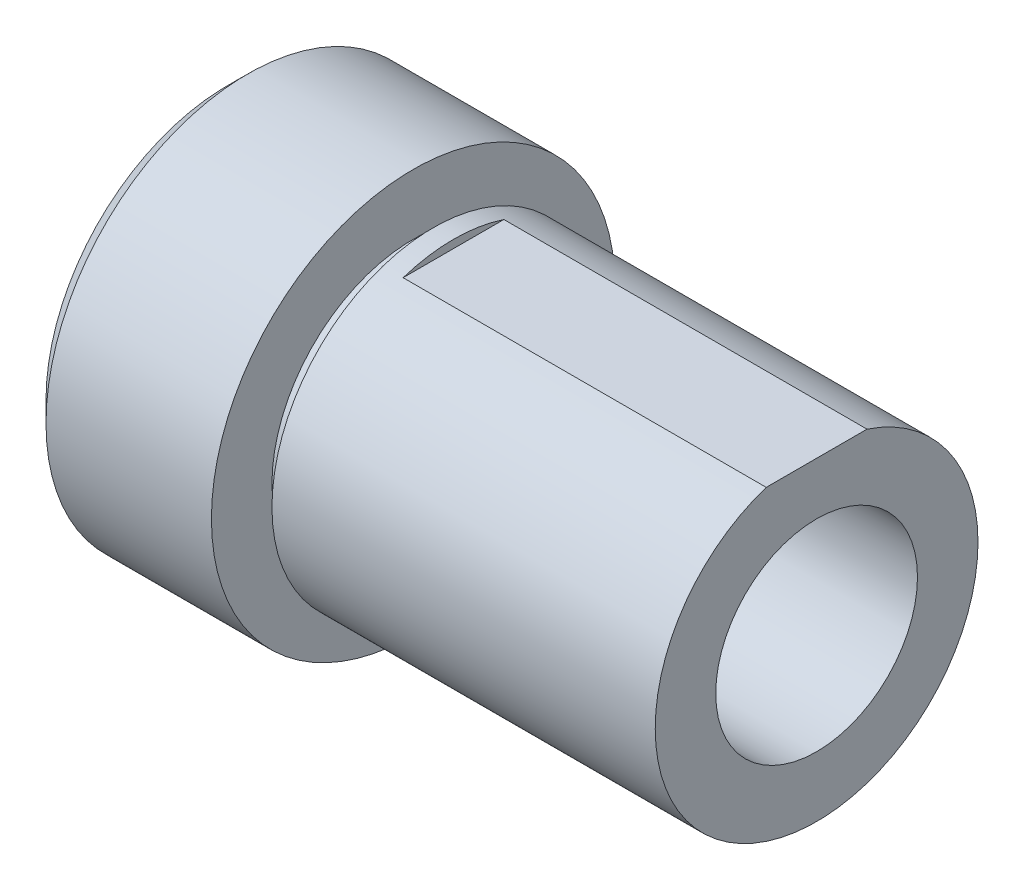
ISO-10303-21;
HEADER;
FILE_DESCRIPTION(('STEP AP214'),'2;1');
FILE_NAME('part.step','',(''),(''),'','','');
FILE_SCHEMA(('AUTOMOTIVE_DESIGN { 1 0 10303 214 1 1 1 1 }'));
ENDSEC;
DATA;
#1=APPLICATION_CONTEXT('core data for automotive mechanical design processes');
#2=APPLICATION_PROTOCOL_DEFINITION('international standard','automotive_design',2000,#1);
#3=PRODUCT_CONTEXT('',#1,'mechanical');
#4=PRODUCT('Part','Part','',(#3));
#5=PRODUCT_RELATED_PRODUCT_CATEGORY('part','',(#4));
#6=PRODUCT_DEFINITION_FORMATION('','',#4);
#7=PRODUCT_DEFINITION_CONTEXT('part definition',#1,'design');
#8=PRODUCT_DEFINITION('design','',#6,#7);
#9=PRODUCT_DEFINITION_SHAPE('','',#8);
#10=(LENGTH_UNIT() NAMED_UNIT(*) SI_UNIT(.MILLI.,.METRE.));
#11=(NAMED_UNIT(*) PLANE_ANGLE_UNIT() SI_UNIT($,.RADIAN.));
#12=(NAMED_UNIT(*) SI_UNIT($,.STERADIAN.) SOLID_ANGLE_UNIT());
#13=UNCERTAINTY_MEASURE_WITH_UNIT(LENGTH_MEASURE(1.E-05),#10,'distance_accuracy_value','');
#14=(GEOMETRIC_REPRESENTATION_CONTEXT(3) GLOBAL_UNCERTAINTY_ASSIGNED_CONTEXT((#13)) GLOBAL_UNIT_ASSIGNED_CONTEXT((#10,
#11,#12)) REPRESENTATION_CONTEXT('',''));
#15=CARTESIAN_POINT('',(0.,0.,0.));
#16=DIRECTION('',(0.,0.,1.));
#17=DIRECTION('',(1.,0.,0.));
#18=AXIS2_PLACEMENT_3D('',#15,#16,#17);
#19=CARTESIAN_POINT('',(4.6,0.,0.));
#20=DIRECTION('',(1.,0.,0.));
#21=DIRECTION('',(0.,0.,-1.));
#22=AXIS2_PLACEMENT_3D('',#19,#20,#21);
#23=PLANE('',#22);
#24=CARTESIAN_POINT('',(4.6,0.,0.));
#25=DIRECTION('',(1.,0.,0.));
#26=DIRECTION('',(0.,0.,-1.));
#27=AXIS2_PLACEMENT_3D('',#24,#25,#26);
#28=CIRCLE('',#27,5.);
#29=CARTESIAN_POINT('',(4.6,0.,-5.));
#30=VERTEX_POINT('',#29);
#31=EDGE_CURVE('E79',#30,#30,#28,.T.);
#32=ORIENTED_EDGE('',*,*,#31,.T.);
#33=EDGE_LOOP('',(#32));
#34=FACE_BOUND('',#33,.T.);
#35=CARTESIAN_POINT('',(4.6,0.,0.));
#36=DIRECTION('',(1.,0.,0.));
#37=DIRECTION('',(0.,0.,-1.));
#38=AXIS2_PLACEMENT_3D('',#35,#36,#37);
#39=CIRCLE('',#38,3.5);
#40=CARTESIAN_POINT('',(4.6,0.,-3.5));
#41=VERTEX_POINT('',#40);
#42=EDGE_CURVE('E107',#41,#41,#39,.T.);
#43=ORIENTED_EDGE('',*,*,#42,.F.);
#44=EDGE_LOOP('',(#43));
#45=FACE_BOUND('',#44,.T.);
#46=ADVANCED_FACE('F32',(#34,#45),#23,.T.);
#47=CARTESIAN_POINT('',(4.6,0.,0.));
#48=DIRECTION('',(-1.,0.,0.));
#49=DIRECTION('',(0.,0.,1.));
#50=AXIS2_PLACEMENT_3D('',#47,#48,#49);
#51=CYLINDRICAL_SURFACE('',#50,5.);
#52=CARTESIAN_POINT('',(0.499999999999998,0.,0.));
#53=DIRECTION('',(1.,0.,0.));
#54=DIRECTION('',(0.,0.,-1.));
#55=AXIS2_PLACEMENT_3D('',#52,#53,#54);
#56=CIRCLE('',#55,5.);
#57=CARTESIAN_POINT('',(0.499999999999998,0.,-5.));
#58=VERTEX_POINT('',#57);
#59=EDGE_CURVE('E82',#58,#58,#56,.T.);
#60=ORIENTED_EDGE('',*,*,#59,.T.);
#61=EDGE_LOOP('',(#60));
#62=FACE_BOUND('',#61,.T.);
#63=ORIENTED_EDGE('',*,*,#31,.F.);
#64=EDGE_LOOP('',(#63));
#65=FACE_BOUND('',#64,.T.);
#66=ADVANCED_FACE('F97',(#62,#65),#51,.T.);
#67=CARTESIAN_POINT('',(0.,0.,0.));
#68=DIRECTION('',(1.,0.,0.));
#69=DIRECTION('',(0.,0.,-1.));
#70=AXIS2_PLACEMENT_3D('',#67,#68,#69);
#71=PLANE('',#70);
#72=CARTESIAN_POINT('',(0.,0.,0.));
#73=DIRECTION('',(1.,0.,0.));
#74=DIRECTION('',(0.,0.,-1.));
#75=AXIS2_PLACEMENT_3D('',#72,#73,#74);
#76=CIRCLE('',#75,4.5);
#77=CARTESIAN_POINT('',(0.,0.,-4.5));
#78=VERTEX_POINT('',#77);
#79=EDGE_CURVE('E85',#78,#78,#76,.F.);
#80=ORIENTED_EDGE('',*,*,#79,.T.);
#81=EDGE_LOOP('',(#80));
#82=FACE_BOUND('',#81,.T.);
#83=CARTESIAN_POINT('',(0.,0.,0.));
#84=DIRECTION('',(1.,0.,0.));
#85=DIRECTION('',(0.,0.,-1.));
#86=AXIS2_PLACEMENT_3D('',#83,#84,#85);
#87=CIRCLE('',#86,2.5);
#88=CARTESIAN_POINT('',(0.,0.,-2.5));
#89=VERTEX_POINT('',#88);
#90=EDGE_CURVE('E73',#89,#89,#87,.T.);
#91=ORIENTED_EDGE('',*,*,#90,.T.);
#92=EDGE_LOOP('',(#91));
#93=FACE_BOUND('',#92,.T.);
#94=ADVANCED_FACE('F89',(#82,#93),#71,.F.);
#95=CARTESIAN_POINT('',(14.6,0.,0.));
#96=DIRECTION('',(-1.,0.,0.));
#97=DIRECTION('',(0.,0.,1.));
#98=AXIS2_PLACEMENT_3D('',#95,#96,#97);
#99=CYLINDRICAL_SURFACE('',#98,4.);
#100=CARTESIAN_POINT('',(5.1,0.,0.));
#101=DIRECTION('',(1.,0.,0.));
#102=DIRECTION('',(0.,0.,-1.));
#103=AXIS2_PLACEMENT_3D('',#100,#101,#102);
#104=CIRCLE('',#103,4.);
#105=CARTESIAN_POINT('',(5.1,0.,-4.));
#106=VERTEX_POINT('',#105);
#107=EDGE_CURVE('E109',#106,#106,#104,.T.);
#108=ORIENTED_EDGE('',*,*,#107,.T.);
#109=EDGE_LOOP('',(#108));
#110=FACE_BOUND('',#109,.T.);
#111=CARTESIAN_POINT('',(14.6,0.,0.));
#112=DIRECTION('',(1.,0.,0.));
#113=DIRECTION('',(0.,0.,-1.));
#114=AXIS2_PLACEMENT_3D('',#111,#112,#113);
#115=CIRCLE('',#114,4.);
#116=CARTESIAN_POINT('',(14.6,3.8,1.24899959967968));
#117=VERTEX_POINT('',#116);
#118=CARTESIAN_POINT('',(14.6,3.8,-1.24899959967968));
#119=VERTEX_POINT('',#118);
#120=EDGE_CURVE('E69',#117,#119,#115,.T.);
#121=ORIENTED_EDGE('',*,*,#120,.F.);
#122=DIRECTION('',(-1.,0.,0.));
#123=VECTOR('',#122,1.);
#124=CARTESIAN_POINT('',(14.6,3.8,1.24899959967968));
#125=LINE('',#124,#123);
#126=CARTESIAN_POINT('',(5.6,3.8,1.24899959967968));
#127=VERTEX_POINT('',#126);
#128=EDGE_CURVE('E47',#117,#127,#125,.T.);
#129=ORIENTED_EDGE('',*,*,#128,.T.);
#130=CARTESIAN_POINT('',(5.6,0.,0.));
#131=DIRECTION('',(-1.,0.,0.));
#132=DIRECTION('',(0.,0.,1.));
#133=AXIS2_PLACEMENT_3D('',#130,#131,#132);
#134=CIRCLE('',#133,4.);
#135=CARTESIAN_POINT('',(5.6,3.8,-1.24899959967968));
#136=VERTEX_POINT('',#135);
#137=EDGE_CURVE('E11',#127,#136,#134,.T.);
#138=ORIENTED_EDGE('',*,*,#137,.T.);
#139=DIRECTION('',(-1.,0.,0.));
#140=VECTOR('',#139,1.);
#141=CARTESIAN_POINT('',(14.6,3.8,-1.24899959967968));
#142=LINE('',#141,#140);
#143=EDGE_CURVE('E56',#136,#119,#142,.F.);
#144=ORIENTED_EDGE('',*,*,#143,.T.);
#145=EDGE_LOOP('',(#121,#129,#138,#144));
#146=FACE_BOUND('',#145,.T.);
#147=ADVANCED_FACE('F68',(#110,#146),#99,.T.);
#148=CARTESIAN_POINT('',(14.6,0.,0.));
#149=DIRECTION('',(1.,0.,0.));
#150=DIRECTION('',(0.,0.,-1.));
#151=AXIS2_PLACEMENT_3D('',#148,#149,#150);
#152=PLANE('',#151);
#153=DIRECTION('',(0.,0.,-1.));
#154=VECTOR('',#153,1.);
#155=CARTESIAN_POINT('',(14.6,3.8,0.));
#156=LINE('',#155,#154);
#157=EDGE_CURVE('E40',#117,#119,#156,.T.);
#158=ORIENTED_EDGE('',*,*,#157,.F.);
#159=ORIENTED_EDGE('',*,*,#120,.T.);
#160=EDGE_LOOP('',(#158,#159));
#161=FACE_BOUND('',#160,.T.);
#162=CARTESIAN_POINT('',(14.6,0.,0.));
#163=DIRECTION('',(1.,0.,0.));
#164=DIRECTION('',(0.,0.,-1.));
#165=AXIS2_PLACEMENT_3D('',#162,#163,#164);
#166=CIRCLE('',#165,2.5);
#167=CARTESIAN_POINT('',(14.6,0.,-2.5));
#168=VERTEX_POINT('',#167);
#169=EDGE_CURVE('E70',#168,#168,#166,.T.);
#170=ORIENTED_EDGE('',*,*,#169,.F.);
#171=EDGE_LOOP('',(#170));
#172=FACE_BOUND('',#171,.T.);
#173=ADVANCED_FACE('F136',(#161,#172),#152,.T.);
#174=CARTESIAN_POINT('',(0.,0.,0.));
#175=DIRECTION('',(1.,0.,0.));
#176=DIRECTION('',(0.,0.,-1.));
#177=AXIS2_PLACEMENT_3D('',#174,#175,#176);
#178=CYLINDRICAL_SURFACE('',#177,2.5);
#179=ORIENTED_EDGE('',*,*,#90,.F.);
#180=EDGE_LOOP('',(#179));
#181=FACE_BOUND('',#180,.T.);
#182=ORIENTED_EDGE('',*,*,#169,.T.);
#183=EDGE_LOOP('',(#182));
#184=FACE_BOUND('',#183,.T.);
#185=ADVANCED_FACE('F94',(#181,#184),#178,.F.);
#186=CARTESIAN_POINT('',(0.499999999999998,0.,0.));
#187=DIRECTION('',(1.,0.,0.));
#188=DIRECTION('',(0.,0.,-1.));
#189=AXIS2_PLACEMENT_3D('',#186,#187,#188);
#190=CONICAL_SURFACE('',#189,5.,0.78539816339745);
#191=ORIENTED_EDGE('',*,*,#79,.F.);
#192=EDGE_LOOP('',(#191));
#193=FACE_BOUND('',#192,.T.);
#194=ORIENTED_EDGE('',*,*,#59,.F.);
#195=EDGE_LOOP('',(#194));
#196=FACE_BOUND('',#195,.T.);
#197=ADVANCED_FACE('F34',(#193,#196),#190,.T.);
#198=CARTESIAN_POINT('',(5.6,3.8,-5.));
#199=DIRECTION('',(-1.,0.,0.));
#200=DIRECTION('',(0.,0.,1.));
#201=AXIS2_PLACEMENT_3D('',#198,#199,#200);
#202=PLANE('',#201);
#203=DIRECTION('',(0.,0.,1.));
#204=VECTOR('',#203,1.);
#205=CARTESIAN_POINT('',(5.6,3.8,-5.));
#206=LINE('',#205,#204);
#207=EDGE_CURVE('E59',#136,#127,#206,.T.);
#208=ORIENTED_EDGE('',*,*,#207,.F.);
#209=ORIENTED_EDGE('',*,*,#137,.F.);
#210=EDGE_LOOP('',(#208,#209));
#211=FACE_BOUND('',#210,.T.);
#212=ADVANCED_FACE('F65',(#211),#202,.F.);
#213=CARTESIAN_POINT('',(14.6,3.8,-5.));
#214=DIRECTION('',(0.,-1.,0.));
#215=DIRECTION('',(1.,0.,0.));
#216=AXIS2_PLACEMENT_3D('',#213,#214,#215);
#217=PLANE('',#216);
#218=ORIENTED_EDGE('',*,*,#157,.T.);
#219=ORIENTED_EDGE('',*,*,#143,.F.);
#220=ORIENTED_EDGE('',*,*,#207,.T.);
#221=ORIENTED_EDGE('',*,*,#128,.F.);
#222=EDGE_LOOP('',(#218,#219,#220,#221));
#223=FACE_BOUND('',#222,.T.);
#224=ADVANCED_FACE('F58',(#223),#217,.F.);
#225=CARTESIAN_POINT('',(5.1,4.,0.));
#226=DIRECTION('',(1.,0.,0.));
#227=DIRECTION('',(0.,0.,-1.));
#228=AXIS2_PLACEMENT_3D('',#225,#226,#227);
#229=PLANE('',#228);
#230=ORIENTED_EDGE('',*,*,#107,.F.);
#231=EDGE_LOOP('',(#230));
#232=FACE_BOUND('',#231,.T.);
#233=CARTESIAN_POINT('',(5.1,0.,0.));
#234=DIRECTION('',(1.,0.,0.));
#235=DIRECTION('',(0.,0.,-1.));
#236=AXIS2_PLACEMENT_3D('',#233,#234,#235);
#237=CIRCLE('',#236,3.5);
#238=CARTESIAN_POINT('',(5.1,0.,-3.5));
#239=VERTEX_POINT('',#238);
#240=EDGE_CURVE('E66',#239,#239,#237,.T.);
#241=ORIENTED_EDGE('',*,*,#240,.T.);
#242=EDGE_LOOP('',(#241));
#243=FACE_BOUND('',#242,.T.);
#244=ADVANCED_FACE('F118',(#232,#243),#229,.F.);
#245=CARTESIAN_POINT('',(4.6,0.,0.));
#246=DIRECTION('',(1.,0.,0.));
#247=DIRECTION('',(0.,0.,-1.));
#248=AXIS2_PLACEMENT_3D('',#245,#246,#247);
#249=CYLINDRICAL_SURFACE('',#248,3.5);
#250=ORIENTED_EDGE('',*,*,#240,.F.);
#251=EDGE_LOOP('',(#250));
#252=FACE_BOUND('',#251,.T.);
#253=ORIENTED_EDGE('',*,*,#42,.T.);
#254=EDGE_LOOP('',(#253));
#255=FACE_BOUND('',#254,.T.);
#256=ADVANCED_FACE('F121',(#252,#255),#249,.T.);
#257=CLOSED_SHELL('',(#46,#66,#94,#147,#173,#185,#197,#212,#224,#244,#256));
#258=MANIFOLD_SOLID_BREP('B2',#257);
#259=ADVANCED_BREP_SHAPE_REPRESENTATION('',(#18,#258),#14);
#260=SHAPE_DEFINITION_REPRESENTATION(#9,#259);
ENDSEC;
END-ISO-10303-21;
